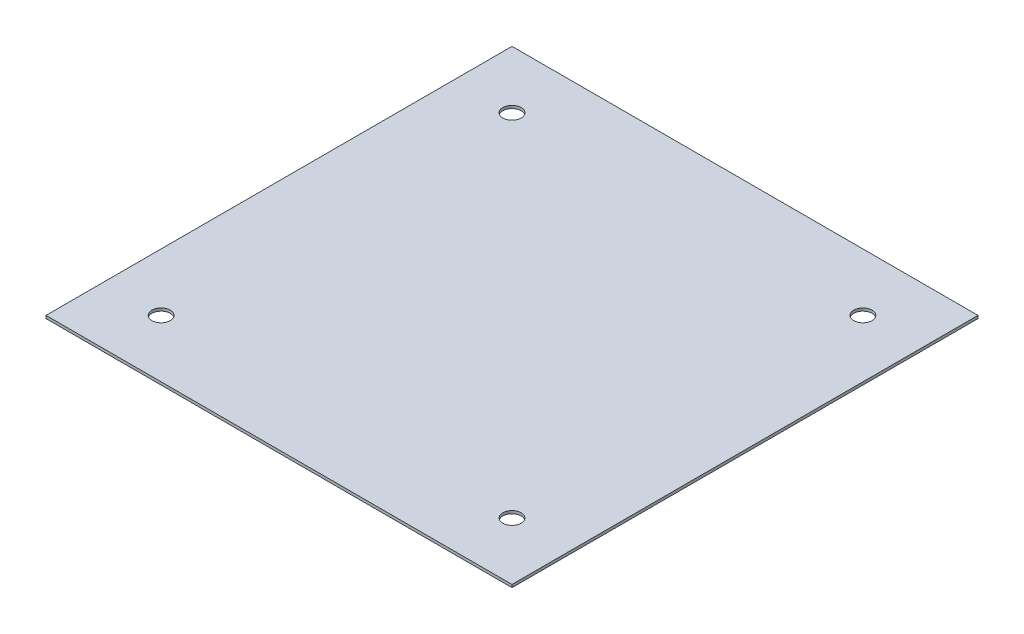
from build123d import *

# Parameters (mm, degrees)
SKETCH1_W           = 332
SKETCH1_H           = 332
SKETCH1_R           = 6.5
BOSS_EXTRUDE1_DEPTH = 2


with BuildPart() as part:
    # Sketch1 → Boss-Extrude1 (new body)
    with BuildSketch(Plane(origin=(0, 0, 0), x_dir=(1, 0, 0), z_dir=(0, 1, 0))):
        Rectangle(SKETCH1_W, SKETCH1_H)
        with Locations(Location((-125, 125, 0), (0, 0, 270))):
            Circle(SKETCH1_R, mode=Mode.SUBTRACT)
        with Locations(Location((125, 125, 0), (0, 0, 90))):
            Circle(SKETCH1_R, mode=Mode.SUBTRACT)
        with Locations(Location((125, -125, 0), (0, 0, 270))):
            Circle(SKETCH1_R, mode=Mode.SUBTRACT)
        with Locations(Location((-125, -125, 0), (0, 0, 90))):
            Circle(SKETCH1_R, mode=Mode.SUBTRACT)
    extrude(amount=BOSS_EXTRUDE1_DEPTH)


solid = part.part
